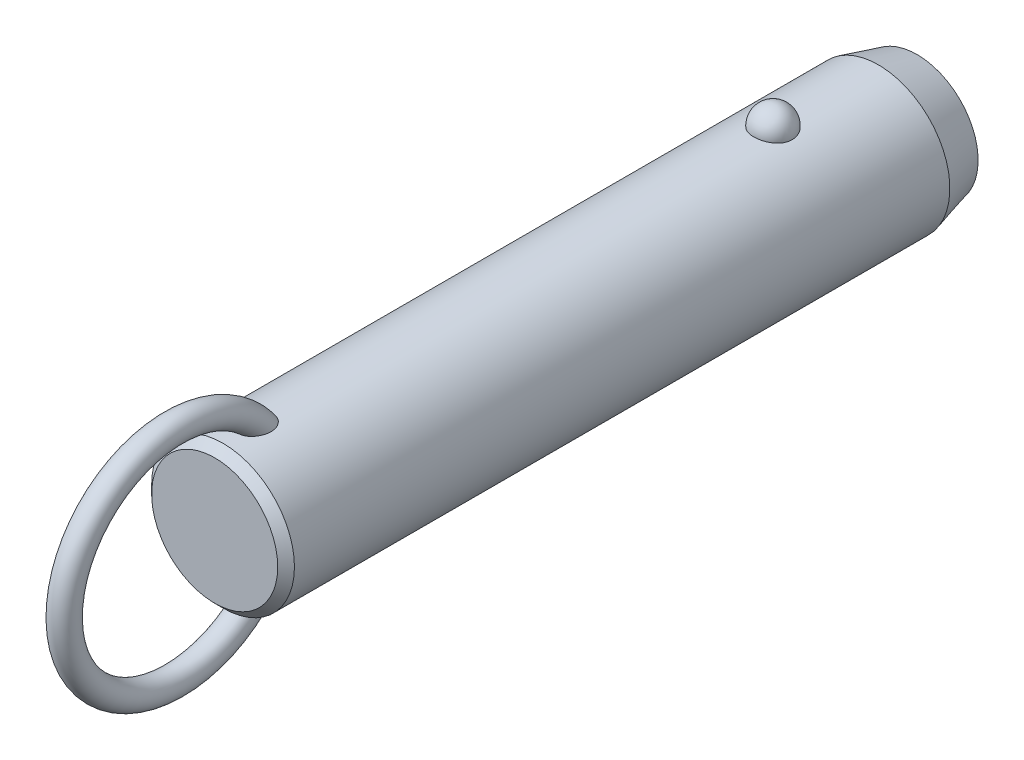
ISO-10303-21;
HEADER;
FILE_DESCRIPTION(('STEP AP214'),'2;1');
FILE_NAME('part.step','',(''),(''),'','','');
FILE_SCHEMA(('AUTOMOTIVE_DESIGN { 1 0 10303 214 1 1 1 1 }'));
ENDSEC;
DATA;
#1=APPLICATION_CONTEXT('core data for automotive mechanical design processes');
#2=APPLICATION_PROTOCOL_DEFINITION('international standard','automotive_design',2000,#1);
#3=PRODUCT_CONTEXT('',#1,'mechanical');
#4=PRODUCT('Part','Part','',(#3));
#5=PRODUCT_RELATED_PRODUCT_CATEGORY('part','',(#4));
#6=PRODUCT_DEFINITION_FORMATION('','',#4);
#7=PRODUCT_DEFINITION_CONTEXT('part definition',#1,'design');
#8=PRODUCT_DEFINITION('design','',#6,#7);
#9=PRODUCT_DEFINITION_SHAPE('','',#8);
#10=(LENGTH_UNIT() NAMED_UNIT(*) SI_UNIT(.MILLI.,.METRE.));
#11=(NAMED_UNIT(*) PLANE_ANGLE_UNIT() SI_UNIT($,.RADIAN.));
#12=(NAMED_UNIT(*) SI_UNIT($,.STERADIAN.) SOLID_ANGLE_UNIT());
#13=UNCERTAINTY_MEASURE_WITH_UNIT(LENGTH_MEASURE(1.E-05),#10,'distance_accuracy_value','');
#14=(GEOMETRIC_REPRESENTATION_CONTEXT(3) GLOBAL_UNCERTAINTY_ASSIGNED_CONTEXT((#13)) GLOBAL_UNIT_ASSIGNED_CONTEXT((#10,
#11,#12)) REPRESENTATION_CONTEXT('',''));
#15=CARTESIAN_POINT('',(0.,0.,0.));
#16=DIRECTION('',(0.,0.,1.));
#17=DIRECTION('',(1.,0.,0.));
#18=AXIS2_PLACEMENT_3D('',#15,#16,#17);
#19=CARTESIAN_POINT('',(0.,0.,71.1));
#20=DIRECTION('',(0.,0.,-1.));
#21=DIRECTION('',(-1.,0.,0.));
#22=AXIS2_PLACEMENT_3D('',#19,#20,#21);
#23=CYLINDRICAL_SURFACE('',#22,11.1);
#24=CARTESIAN_POINT('',(2.9724815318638,10.6945945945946,-3.));
#25=CARTESIAN_POINT('',(2.97247830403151,10.6945972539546,-2.83225059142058));
#26=CARTESIAN_POINT('',(2.95876598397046,10.6984356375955,-2.66445972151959));
#27=CARTESIAN_POINT('',(2.90424529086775,10.7133624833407,-2.33362381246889));
#28=CARTESIAN_POINT('',(2.8634252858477,10.7244540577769,-2.1705808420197));
#29=CARTESIAN_POINT('',(2.75573657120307,10.7526272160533,-1.85396767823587));
#30=CARTESIAN_POINT('',(2.68887937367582,10.7697061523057,-1.70039333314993));
#31=CARTESIAN_POINT('',(2.53079696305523,10.8079438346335,-1.40691598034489));
#32=CARTESIAN_POINT('',(2.43957264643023,10.8291024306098,-1.2670124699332));
#33=CARTESIAN_POINT('',(2.23458150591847,10.8732541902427,-1.00409565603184));
#34=CARTESIAN_POINT('',(2.12071295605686,10.8962553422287,-0.881162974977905));
#35=CARTESIAN_POINT('',(1.87365402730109,10.9414421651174,-0.656352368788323));
#36=CARTESIAN_POINT('',(1.74046358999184,10.9636278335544,-0.554474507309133));
#37=CARTESIAN_POINT('',(1.45872188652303,11.0046495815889,-0.374872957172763));
#38=CARTESIAN_POINT('',(1.31021276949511,11.0234944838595,-0.297085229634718));
#39=CARTESIAN_POINT('',(1.00170030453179,11.0557957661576,-0.167529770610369));
#40=CARTESIAN_POINT('',(0.841698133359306,11.0692526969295,-0.115759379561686));
#41=CARTESIAN_POINT('',(0.517607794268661,11.0890932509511,-0.0403925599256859));
#42=CARTESIAN_POINT('',(0.353633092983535,11.0955916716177,-0.0163383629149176));
#43=CARTESIAN_POINT('',(0.0238420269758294,11.1011989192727,0.0044517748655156));
#44=CARTESIAN_POINT('',(-0.141974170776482,11.1003084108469,0.00119017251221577));
#45=CARTESIAN_POINT('',(-0.468405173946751,11.0912990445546,-0.0323233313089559));
#46=CARTESIAN_POINT('',(-0.629059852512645,11.0832767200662,-0.0622147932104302));
#47=CARTESIAN_POINT('',(-0.942937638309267,11.0609962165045,-0.147645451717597));
#48=CARTESIAN_POINT('',(-1.09616062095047,11.0467379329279,-0.203185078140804));
#49=CARTESIAN_POINT('',(-1.39181061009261,11.0134071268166,-0.3387529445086));
#50=CARTESIAN_POINT('',(-1.53417383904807,10.9943086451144,-0.418913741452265));
#51=CARTESIAN_POINT('',(-1.80342160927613,10.9533667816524,-0.60144882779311));
#52=CARTESIAN_POINT('',(-1.9303046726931,10.9315231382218,-0.703825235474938));
#53=CARTESIAN_POINT('',(-2.16747598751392,10.887005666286,-0.930091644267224));
#54=CARTESIAN_POINT('',(-2.27742774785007,10.8643239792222,-1.05433291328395));
#55=CARTESIAN_POINT('',(-2.47517316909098,10.8209886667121,-1.31966633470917));
#56=CARTESIAN_POINT('',(-2.56296538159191,10.8003351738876,-1.46075958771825));
#57=CARTESIAN_POINT('',(-2.71500300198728,10.7631304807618,-1.75753646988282));
#58=CARTESIAN_POINT('',(-2.77898901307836,10.7466250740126,-1.91335887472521));
#59=CARTESIAN_POINT('',(-2.88046189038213,10.7198747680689,-2.2339152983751));
#60=CARTESIAN_POINT('',(-2.91794947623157,10.709629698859,-2.39864907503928));
#61=CARTESIAN_POINT('',(-2.96537819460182,10.6965949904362,-2.73165170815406));
#62=CARTESIAN_POINT('',(-2.97542891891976,10.693775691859,-2.89990378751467));
#63=CARTESIAN_POINT('',(-2.96804271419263,10.6958279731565,-3.235752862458));
#64=CARTESIAN_POINT('',(-2.95060646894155,10.7006993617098,-3.40334987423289));
#65=CARTESIAN_POINT('',(-2.88883358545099,10.71753912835,-3.73233906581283));
#66=CARTESIAN_POINT('',(-2.84462026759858,10.7294749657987,-3.89375610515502));
#67=CARTESIAN_POINT('',(-2.73050447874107,10.7590797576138,-4.20667949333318));
#68=CARTESIAN_POINT('',(-2.66060103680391,10.7767489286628,-4.35818546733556));
#69=CARTESIAN_POINT('',(-2.49642559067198,10.8159599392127,-4.6478542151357));
#70=CARTESIAN_POINT('',(-2.40203047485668,10.8375211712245,-4.78594458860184));
#71=CARTESIAN_POINT('',(-2.19143488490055,10.8820570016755,-5.0441038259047));
#72=CARTESIAN_POINT('',(-2.07523364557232,10.9050316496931,-5.16417205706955));
#73=CARTESIAN_POINT('',(-1.82361254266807,10.9499219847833,-5.38334833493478));
#74=CARTESIAN_POINT('',(-1.68812945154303,10.9718338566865,-5.48238464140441));
#75=CARTESIAN_POINT('',(-1.40191298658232,11.0120611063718,-5.65618873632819));
#76=CARTESIAN_POINT('',(-1.25118062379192,11.0303767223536,-5.73095813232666));
#77=CARTESIAN_POINT('',(-0.940570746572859,11.0611653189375,-5.85334725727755));
#78=CARTESIAN_POINT('',(-0.780821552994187,11.0737044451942,-5.90127578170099));
#79=CARTESIAN_POINT('',(-0.455204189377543,11.0918598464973,-5.96992976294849));
#80=CARTESIAN_POINT('',(-0.289336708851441,11.0974768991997,-5.99065827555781));
#81=CARTESIAN_POINT('',(0.0406846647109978,11.1011307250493,-6.00418773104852));
#82=CARTESIAN_POINT('',(0.204817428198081,11.099299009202,-5.99747318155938));
#83=CARTESIAN_POINT('',(0.5295530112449,11.088551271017,-5.9574031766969));
#84=CARTESIAN_POINT('',(0.69015594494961,11.0796354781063,-5.92404858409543));
#85=CARTESIAN_POINT('',(1.0027760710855,11.0557204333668,-5.83180084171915));
#86=CARTESIAN_POINT('',(1.15482001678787,11.0407414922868,-5.77299291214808));
#87=CARTESIAN_POINT('',(1.44678373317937,11.0062913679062,-5.63147366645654));
#88=CARTESIAN_POINT('',(1.58670279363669,10.9868199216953,-5.54876095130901));
#89=CARTESIAN_POINT('',(1.8527023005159,10.9451315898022,-5.36027644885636));
#90=CARTESIAN_POINT('',(1.97855158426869,10.9228788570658,-5.25418644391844));
#91=CARTESIAN_POINT('',(2.21080872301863,10.8782509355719,-5.02251354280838));
#92=CARTESIAN_POINT('',(2.31721312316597,10.8558757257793,-4.89692718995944));
#93=CARTESIAN_POINT('',(2.5094551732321,10.8130715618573,-4.62745408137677));
#94=CARTESIAN_POINT('',(2.59493284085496,10.7926798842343,-4.48330448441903));
#95=CARTESIAN_POINT('',(2.740862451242,10.7565495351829,-4.18236358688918));
#96=CARTESIAN_POINT('',(2.80132490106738,10.7408089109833,-4.02557762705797));
#97=CARTESIAN_POINT('',(2.88959070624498,10.7173718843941,-3.72475308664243));
#98=CARTESIAN_POINT('',(2.92062102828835,10.7088950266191,-3.58171216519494));
#99=CARTESIAN_POINT('',(2.96206765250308,10.6975052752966,-3.29245795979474));
#100=CARTESIAN_POINT('',(2.97248434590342,10.6945922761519,-3.14624473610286));
#101=CARTESIAN_POINT('',(2.9724815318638,10.6945945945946,-3.));
#102=B_SPLINE_CURVE_WITH_KNOTS('',3,(#24,#25,#26,#27,#28,#29,#30,#31,#32,#33,#34,#35,#36,#37,
#38,#39,#40,#41,#42,#43,#44,#45,#46,#47,#48,#49,#50,#51,#52,#53,#54,#55,#56,#57,#58,#59,#60,#61,
#62,#63,#64,#65,#66,#67,#68,#69,#70,#71,#72,#73,#74,#75,#76,#77,#78,#79,#80,#81,#82,#83,#84,#85,
#86,#87,#88,#89,#90,#91,#92,#93,#94,#95,#96,#97,#98,#99,#100,#101),.UNSPECIFIED.,.T.,.F.,(4,2,2,
2,2,2,2,2,2,2,2,2,2,2,2,2,2,2,2,2,2,2,2,2,2,2,2,2,2,2,2,2,2,2,2,2,2,2,4),(0.,0.502722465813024,
1.00566079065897,1.5083769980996,2.01107471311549,2.51608392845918,3.02109467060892,
3.52475118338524,4.02835620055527,4.523518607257,5.0186364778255,5.50715297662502,
5.9956776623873,6.48688002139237,6.97812923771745,7.47814366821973,7.9781907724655,
8.48353712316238,8.9888697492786,9.49218093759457,9.99547960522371,10.4964777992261,
10.997494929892,11.5010810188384,12.0046847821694,12.5099796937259,13.0152411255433,
13.5145635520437,14.0138298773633,14.5043200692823,14.9947943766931,15.4836390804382,
15.9725123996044,16.4685040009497,16.9645836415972,17.4686765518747,17.972557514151,
18.410841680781,18.849117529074),.UNSPECIFIED.);
#103=CARTESIAN_POINT('',(2.9724815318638,10.6945945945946,-3.));
#104=VERTEX_POINT('',#103);
#105=EDGE_CURVE('E41',#104,#104,#102,.T.);
#106=ORIENTED_EDGE('',*,*,#105,.T.);
#107=EDGE_LOOP('',(#106));
#108=FACE_BOUND('',#107,.T.);
#109=CARTESIAN_POINT('',(0.,0.,82.5));
#110=DIRECTION('',(0.,0.,1.));
#111=DIRECTION('',(1.,0.,0.));
#112=AXIS2_PLACEMENT_3D('',#109,#110,#111);
#113=CIRCLE('',#112,11.1);
#114=CARTESIAN_POINT('',(11.1,0.,82.5));
#115=VERTEX_POINT('',#114);
#116=EDGE_CURVE('E10',#115,#115,#113,.F.);
#117=ORIENTED_EDGE('',*,*,#116,.T.);
#118=EDGE_LOOP('',(#117));
#119=FACE_BOUND('',#118,.T.);
#120=CARTESIAN_POINT('',(-0.564520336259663,-11.0856356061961,74.757815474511));
#121=CARTESIAN_POINT('',(-0.667202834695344,-11.0804062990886,74.7912839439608));
#122=CARTESIAN_POINT('',(-0.766875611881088,-11.0738877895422,74.8338357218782));
#123=CARTESIAN_POINT('',(-0.957284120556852,-11.0590576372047,74.9354190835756));
#124=CARTESIAN_POINT('',(-1.04801616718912,-11.0507452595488,74.9944574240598));
#125=CARTESIAN_POINT('',(-1.21800952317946,-11.0333016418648,75.1265293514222));
#126=CARTESIAN_POINT('',(-1.29730805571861,-11.0241732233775,75.1995156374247));
#127=CARTESIAN_POINT('',(-1.44337665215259,-11.0060026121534,75.3570374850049));
#128=CARTESIAN_POINT('',(-1.51014622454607,-10.9969604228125,75.4415734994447));
#129=CARTESIAN_POINT('',(-1.63454620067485,-10.9791841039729,75.6255213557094));
#130=CARTESIAN_POINT('',(-1.69127003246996,-10.9705107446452,75.7255493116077));
#131=CARTESIAN_POINT('',(-1.78980785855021,-10.9548648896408,75.9327902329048));
#132=CARTESIAN_POINT('',(-1.83161214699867,-10.9478935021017,76.0400078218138));
#133=CARTESIAN_POINT('',(-1.91557028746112,-10.9335803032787,76.3054080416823));
#134=CARTESIAN_POINT('',(-1.95040620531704,-10.9273269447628,76.4659806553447));
#135=CARTESIAN_POINT('',(-1.99388326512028,-10.9194709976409,76.7906977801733));
#136=CARTESIAN_POINT('',(-2.00248051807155,-10.9178762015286,76.9548478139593));
#137=CARTESIAN_POINT('',(-1.99551615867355,-10.9191578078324,77.3246504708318));
#138=CARTESIAN_POINT('',(-1.9732206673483,-10.9232807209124,77.5301911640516));
#139=CARTESIAN_POINT('',(-1.91529761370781,-10.9335244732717,77.8335954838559));
#140=CARTESIAN_POINT('',(-1.8918457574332,-10.9376266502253,77.9340883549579));
#141=CARTESIAN_POINT('',(-1.83700674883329,-10.9469720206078,78.132855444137));
#142=CARTESIAN_POINT('',(-1.80562070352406,-10.9522150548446,78.2311299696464));
#143=CARTESIAN_POINT('',(-1.73463055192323,-10.9636837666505,78.4259148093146));
#144=CARTESIAN_POINT('',(-1.69493416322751,-10.9699202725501,78.5223907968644));
#145=CARTESIAN_POINT('',(-1.60745141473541,-10.9830806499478,78.7116262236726));
#146=CARTESIAN_POINT('',(-1.55966150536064,-10.9900048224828,78.8043840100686));
#147=CARTESIAN_POINT('',(-1.45591812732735,-11.0042280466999,78.9846907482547));
#148=CARTESIAN_POINT('',(-1.40000013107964,-11.0115253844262,79.0722601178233));
#149=CARTESIAN_POINT('',(-1.27937470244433,-11.0261911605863,79.2410298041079));
#150=CARTESIAN_POINT('',(-1.21467835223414,-11.0335594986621,79.3222379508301));
#151=CARTESIAN_POINT('',(-1.08218150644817,-11.0473027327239,79.4690010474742));
#152=CARTESIAN_POINT('',(-1.01522633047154,-11.0537063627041,79.535309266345));
#153=CARTESIAN_POINT('',(-0.872952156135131,-11.065850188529,79.6583780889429));
#154=CARTESIAN_POINT('',(-0.797642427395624,-11.0715911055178,79.7151491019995));
#155=CARTESIAN_POINT('',(-0.651396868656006,-11.081071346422,79.8075155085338));
#156=CARTESIAN_POINT('',(-0.581712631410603,-11.0849841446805,79.8450491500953));
#157=CARTESIAN_POINT('',(-0.437066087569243,-11.0916271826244,79.9082594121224));
#158=CARTESIAN_POINT('',(-0.362109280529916,-11.0943586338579,79.9339481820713));
#159=CARTESIAN_POINT('',(-0.207828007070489,-11.0983242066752,79.971117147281));
#160=CARTESIAN_POINT('',(-0.128467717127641,-11.0995432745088,79.9824545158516));
#161=CARTESIAN_POINT('',(0.0309101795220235,-11.1002423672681,79.9889658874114));
#162=CARTESIAN_POINT('',(0.110927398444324,-11.0997233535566,79.9841488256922));
#163=CARTESIAN_POINT('',(0.256406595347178,-11.097240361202,79.9609599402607));
#164=CARTESIAN_POINT('',(0.32223577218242,-11.0955074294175,79.9447543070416));
#165=CARTESIAN_POINT('',(0.450635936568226,-11.0910350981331,79.9026008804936));
#166=CARTESIAN_POINT('',(0.513205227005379,-11.0882951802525,79.8766480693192));
#167=CARTESIAN_POINT('',(0.662626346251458,-11.0805620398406,79.8026073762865));
#168=CARTESIAN_POINT('',(0.747127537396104,-11.0751144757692,79.7498452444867));
#169=CARTESIAN_POINT('',(0.906756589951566,-11.0631932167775,79.6317206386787));
#170=CARTESIAN_POINT('',(0.981859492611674,-11.0567168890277,79.5663257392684));
#171=CARTESIAN_POINT('',(1.10712207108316,-11.0447856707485,79.4422633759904));
#172=CARTESIAN_POINT('',(1.15909566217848,-11.0394280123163,79.3853831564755));
#173=CARTESIAN_POINT('',(1.25791923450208,-11.0286040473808,79.2673271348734));
#174=CARTESIAN_POINT('',(1.30476642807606,-11.0231376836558,79.2061490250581));
#175=CARTESIAN_POINT('',(1.43818612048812,-11.0068027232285,79.0173051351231));
#176=CARTESIAN_POINT('',(1.51751767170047,-10.9960104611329,78.8844531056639));
#177=CARTESIAN_POINT('',(1.63597546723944,-10.9788847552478,78.6531371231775));
#178=CARTESIAN_POINT('',(1.67988876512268,-10.9722190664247,78.5570530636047));
#179=CARTESIAN_POINT('',(1.75953241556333,-10.9597298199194,78.3614311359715));
#180=CARTESIAN_POINT('',(1.79525967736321,-10.9539065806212,78.2618919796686));
#181=CARTESIAN_POINT('',(1.85844731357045,-10.9433632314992,78.0602111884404));
#182=CARTESIAN_POINT('',(1.88591073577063,-10.9386427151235,77.9580705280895));
#183=CARTESIAN_POINT('',(1.93234324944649,-10.9305350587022,77.7518191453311));
#184=CARTESIAN_POINT('',(1.95131065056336,-10.9271481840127,77.6477080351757));
#185=CARTESIAN_POINT('',(1.99040203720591,-10.9201183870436,77.3654588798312));
#186=CARTESIAN_POINT('',(2.00221217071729,-10.9179256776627,77.1860370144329));
#187=CARTESIAN_POINT('',(1.99711676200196,-10.9188636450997,76.8277133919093));
#188=CARTESIAN_POINT('',(1.98026150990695,-10.9219849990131,76.648811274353));
#189=CARTESIAN_POINT('',(1.92151657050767,-10.9324473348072,76.3364514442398));
#190=CARTESIAN_POINT('',(1.88605081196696,-10.9386915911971,76.2017594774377));
#191=CARTESIAN_POINT('',(1.7939302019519,-10.9541780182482,75.9399669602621));
#192=CARTESIAN_POINT('',(1.73729868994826,-10.9634168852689,75.8128582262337));
#193=CARTESIAN_POINT('',(1.612370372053,-10.9824218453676,75.5894184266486));
#194=CARTESIAN_POINT('',(1.54715374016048,-10.9918945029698,75.4913455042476));
#195=CARTESIAN_POINT('',(1.40127026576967,-11.0114415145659,75.3074341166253));
#196=CARTESIAN_POINT('',(1.32060742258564,-11.0215157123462,75.2215924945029));
#197=CARTESIAN_POINT('',(1.14474787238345,-11.041168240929,75.0651630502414));
#198=CARTESIAN_POINT('',(1.04947805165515,-11.0507437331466,74.9946565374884));
#199=CARTESIAN_POINT('',(0.847278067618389,-11.0680789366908,74.872640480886));
#200=CARTESIAN_POINT('',(0.740351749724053,-11.0758392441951,74.8211246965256));
#201=CARTESIAN_POINT('',(0.529289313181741,-11.0878275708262,74.7434852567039));
#202=CARTESIAN_POINT('',(0.425895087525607,-11.0923259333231,74.715377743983));
#203=CARTESIAN_POINT('',(0.215723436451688,-11.0984001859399,74.6777038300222));
#204=CARTESIAN_POINT('',(0.108947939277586,-11.0999777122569,74.6681270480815));
#205=CARTESIAN_POINT('',(-0.0938962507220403,-11.1000196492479,74.6678773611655));
#206=CARTESIAN_POINT('',(-0.189967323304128,-11.0987797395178,74.6754089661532));
#207=CARTESIAN_POINT('',(-0.379657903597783,-11.0939111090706,74.7055079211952));
#208=CARTESIAN_POINT('',(-0.473277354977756,-11.0902823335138,74.7280756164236));
#209=CARTESIAN_POINT('',(-0.564520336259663,-11.0856356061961,74.757815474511));
#210=B_SPLINE_CURVE_WITH_KNOTS('',3,(#120,#121,#122,#123,#124,#125,#126,#127,#128,#129,#130,
#131,#132,#133,#134,#135,#136,#137,#138,#139,#140,#141,#142,#143,#144,#145,#146,#147,#148,#149,
#150,#151,#152,#153,#154,#155,#156,#157,#158,#159,#160,#161,#162,#163,#164,#165,#166,#167,#168,
#169,#170,#171,#172,#173,#174,#175,#176,#177,#178,#179,#180,#181,#182,#183,#184,#185,#186,#187,
#188,#189,#190,#191,#192,#193,#194,#195,#196,#197,#198,#199,#200,#201,#202,#203,#204,#205,#206,
#207,#208,#209),.UNSPECIFIED.,.T.,.F.,(4,2,2,2,2,2,2,2,2,2,2,2,2,2,2,2,2,2,2,2,2,2,2,2,2,2,2,2,
2,2,2,2,2,2,2,2,2,2,2,2,2,2,2,2,4),(0.,0.323999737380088,0.648132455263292,0.971184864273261,
1.29424994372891,1.6388623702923,1.98369857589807,2.47426059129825,2.96564271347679,
3.58257396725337,3.89215258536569,4.20168803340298,4.51486273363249,4.82817514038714,
5.14015911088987,5.45175282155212,5.73442856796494,6.01679375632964,6.25364580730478,
6.49025437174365,6.7291996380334,6.96801276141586,7.17061258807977,7.37331685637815,
7.67094989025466,7.96935728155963,8.2007506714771,8.43226927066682,8.89581623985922,
9.21306533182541,9.53043400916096,9.84768549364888,10.1650000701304,10.70229304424,
11.2386443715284,11.6553390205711,12.0715755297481,12.4245637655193,12.7774607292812,
13.1321855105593,13.4867936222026,13.8068771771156,14.1267813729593,14.4146787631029,
14.7025827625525),.UNSPECIFIED.);
#211=CARTESIAN_POINT('',(-0.564520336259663,-11.0856356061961,74.757815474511));
#212=VERTEX_POINT('',#211);
#213=EDGE_CURVE('E59',#212,#212,#210,.T.);
#214=ORIENTED_EDGE('',*,*,#213,.T.);
#215=EDGE_LOOP('',(#214));
#216=FACE_BOUND('',#215,.T.);
#217=CARTESIAN_POINT('',(-0.564520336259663,11.0856356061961,74.757815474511));
#218=CARTESIAN_POINT('',(-0.468542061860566,11.0905203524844,74.7265456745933));
#219=CARTESIAN_POINT('',(-0.36979381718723,11.0942886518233,74.7031576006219));
#220=CARTESIAN_POINT('',(-0.169555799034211,11.0991586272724,74.6730858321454));
#221=CARTESIAN_POINT('',(-0.0680604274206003,11.1002543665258,74.6664393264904));
#222=CARTESIAN_POINT('',(0.134549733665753,11.099646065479,74.6701579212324));
#223=CARTESIAN_POINT('',(0.235664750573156,11.0979441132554,74.6805103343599));
#224=CARTESIAN_POINT('',(0.43463240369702,11.0919342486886,74.7178318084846));
#225=CARTESIAN_POINT('',(0.532486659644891,11.0876276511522,74.7447924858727));
#226=CARTESIAN_POINT('',(0.722445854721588,11.0768742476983,74.8144096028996));
#227=CARTESIAN_POINT('',(0.814543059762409,11.0704246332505,74.8570866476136));
#228=CARTESIAN_POINT('',(0.99056508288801,11.0560659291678,74.9566487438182));
#229=CARTESIAN_POINT('',(1.07448844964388,11.048156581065,75.0135363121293));
#230=CARTESIAN_POINT('',(1.23562672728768,11.0313221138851,75.1422106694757));
#231=CARTESIAN_POINT('',(1.31242684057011,11.0223686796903,75.2145117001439));
#232=CARTESIAN_POINT('',(1.45398030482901,11.0045918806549,75.3700425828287));
#233=CARTESIAN_POINT('',(1.51873073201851,10.9957685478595,75.4532750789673));
#234=CARTESIAN_POINT('',(1.64107232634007,10.9782087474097,75.6363842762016));
#235=CARTESIAN_POINT('',(1.69743176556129,10.9695572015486,75.7370893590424));
#236=CARTESIAN_POINT('',(1.79515063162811,10.9539887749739,75.9456264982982));
#237=CARTESIAN_POINT('',(1.83649966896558,10.9470730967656,76.0534634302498));
#238=CARTESIAN_POINT('',(1.91931148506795,10.9329211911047,76.3203995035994));
#239=CARTESIAN_POINT('',(1.9534010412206,10.9267904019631,76.4818612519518));
#240=CARTESIAN_POINT('',(1.99526195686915,10.9192174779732,76.8082163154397));
#241=CARTESIAN_POINT('',(2.00298989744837,10.9177830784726,76.9731148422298));
#242=CARTESIAN_POINT('',(1.99396251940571,10.9194420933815,77.3441006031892));
#243=CARTESIAN_POINT('',(1.97050829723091,10.923774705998,77.5500387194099));
#244=CARTESIAN_POINT('',(1.91079643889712,10.9343131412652,77.8539019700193));
#245=CARTESIAN_POINT('',(1.88673702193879,10.9385106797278,77.9545296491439));
#246=CARTESIAN_POINT('',(1.83065508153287,10.9480376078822,78.1535107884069));
#247=CARTESIAN_POINT('',(1.79863369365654,10.9533668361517,78.251864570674));
#248=CARTESIAN_POINT('',(1.72633365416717,10.9649954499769,78.446720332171));
#249=CARTESIAN_POINT('',(1.68596409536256,10.9713053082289,78.5431879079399));
#250=CARTESIAN_POINT('',(1.59707998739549,10.9845964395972,78.7323233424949));
#251=CARTESIAN_POINT('',(1.54856169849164,10.9915780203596,78.8249894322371));
#252=CARTESIAN_POINT('',(1.44330168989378,11.0058935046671,79.0049752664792));
#253=CARTESIAN_POINT('',(1.38659749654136,11.0132257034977,79.092316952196));
#254=CARTESIAN_POINT('',(1.26431158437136,11.0279330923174,79.2604563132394));
#255=CARTESIAN_POINT('',(1.19874160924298,11.0353082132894,79.3412624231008));
#256=CARTESIAN_POINT('',(1.06542088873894,11.0489310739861,79.4859856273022));
#257=CARTESIAN_POINT('',(0.998640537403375,11.0552153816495,79.550784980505));
#258=CARTESIAN_POINT('',(0.856896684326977,11.0671032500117,79.6708462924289));
#259=CARTESIAN_POINT('',(0.781942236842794,11.0727075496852,79.7261186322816));
#260=CARTESIAN_POINT('',(0.636276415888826,11.081949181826,79.8159721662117));
#261=CARTESIAN_POINT('',(0.566755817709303,11.0857572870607,79.8524410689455));
#262=CARTESIAN_POINT('',(0.422602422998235,11.0921860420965,79.9135333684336));
#263=CARTESIAN_POINT('',(0.347974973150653,11.0948079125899,79.9381689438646));
#264=CARTESIAN_POINT('',(0.194593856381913,11.0985608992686,79.9733233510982));
#265=CARTESIAN_POINT('',(0.115807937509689,11.0996777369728,79.9837069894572));
#266=CARTESIAN_POINT('',(-0.0422499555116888,11.1002003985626,79.9885747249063));
#267=CARTESIAN_POINT('',(-0.121521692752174,11.09960699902,79.983066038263));
#268=CARTESIAN_POINT('',(-0.266046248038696,11.0970123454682,79.9588271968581));
#269=CARTESIAN_POINT('',(-0.331661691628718,11.0952283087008,79.9421356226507));
#270=CARTESIAN_POINT('',(-0.459588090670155,11.0906663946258,79.8991117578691));
#271=CARTESIAN_POINT('',(-0.521897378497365,11.0878880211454,79.872774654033));
#272=CARTESIAN_POINT('',(-0.671446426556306,11.0800342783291,79.7975130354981));
#273=CARTESIAN_POINT('',(-0.756250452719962,11.0744969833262,79.7438182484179));
#274=CARTESIAN_POINT('',(-0.916349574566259,11.0624045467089,79.6238029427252));
#275=CARTESIAN_POINT('',(-0.99161892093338,11.0558467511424,79.5574493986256));
#276=CARTESIAN_POINT('',(-1.11713140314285,11.0437783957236,79.4316335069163));
#277=CARTESIAN_POINT('',(-1.16920539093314,11.0383619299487,79.3739524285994));
#278=CARTESIAN_POINT('',(-1.26817476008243,11.02743010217,79.2542809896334));
#279=CARTESIAN_POINT('',(-1.31506731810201,11.0219146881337,79.1922883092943));
#280=CARTESIAN_POINT('',(-1.40399813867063,11.0109399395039,79.0647843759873));
#281=CARTESIAN_POINT('',(-1.4460286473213,11.0054807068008,78.9992677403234));
#282=CARTESIAN_POINT('',(-1.52538779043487,10.9947621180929,78.8654223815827));
#283=CARTESIAN_POINT('',(-1.56271516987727,10.9895028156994,78.7970929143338));
#284=CARTESIAN_POINT('',(-1.64537943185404,10.9774790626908,78.6332101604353));
#285=CARTESIAN_POINT('',(-1.68879497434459,10.9708503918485,78.5366735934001));
#286=CARTESIAN_POINT('',(-1.76740738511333,10.9584602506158,78.3402369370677));
#287=CARTESIAN_POINT('',(-1.80260120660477,10.95269910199,78.2403356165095));
#288=CARTESIAN_POINT('',(-1.86468657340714,10.9423003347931,78.0379663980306));
#289=CARTESIAN_POINT('',(-1.8915816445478,10.9376622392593,77.9354996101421));
#290=CARTESIAN_POINT('',(-1.93682458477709,10.9297405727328,77.7286429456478));
#291=CARTESIAN_POINT('',(-1.9551708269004,10.9264572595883,77.6242527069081));
#292=CARTESIAN_POINT('',(-1.99232562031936,10.9197647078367,77.3426287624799));
#293=CARTESIAN_POINT('',(-2.00294603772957,10.9177914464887,77.1641857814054));
#294=CARTESIAN_POINT('',(-1.99566675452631,10.9191290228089,76.8079962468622));
#295=CARTESIAN_POINT('',(-1.97781651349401,10.9224306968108,76.6302490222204));
#296=CARTESIAN_POINT('',(-1.91747214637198,10.9331592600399,76.3197921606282));
#297=CARTESIAN_POINT('',(-1.88131022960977,10.9395108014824,76.185825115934));
#298=CARTESIAN_POINT('',(-1.7879038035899,10.9551659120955,75.9255975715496));
#299=CARTESIAN_POINT('',(-1.7306830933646,10.9644661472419,75.7993285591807));
#300=CARTESIAN_POINT('',(-1.60475573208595,10.9835398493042,75.5774156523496));
#301=CARTESIAN_POINT('',(-1.53908879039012,10.9930297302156,75.4800265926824));
#302=CARTESIAN_POINT('',(-1.39238608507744,11.0125708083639,75.2975250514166));
#303=CARTESIAN_POINT('',(-1.31135150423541,11.0226219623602,75.2124116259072));
#304=CARTESIAN_POINT('',(-1.14382035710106,11.0411991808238,75.0652994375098));
#305=CARTESIAN_POINT('',(-1.05858500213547,11.0497792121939,75.0018693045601));
#306=CARTESIAN_POINT('',(-0.878723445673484,11.0655285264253,74.8902505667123));
#307=CARTESIAN_POINT('',(-0.784123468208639,11.0727015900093,74.8420208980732));
#308=CARTESIAN_POINT('',(-0.646163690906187,11.0812501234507,74.786023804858));
#309=CARTESIAN_POINT('',(-0.605595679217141,11.0835451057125,74.7711978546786));
#310=CARTESIAN_POINT('',(-0.564520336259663,11.0856356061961,74.757815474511));
#311=B_SPLINE_CURVE_WITH_KNOTS('',3,(#217,#218,#219,#220,#221,#222,#223,#224,#225,#226,#227,
#228,#229,#230,#231,#232,#233,#234,#235,#236,#237,#238,#239,#240,#241,#242,#243,#244,#245,#246,
#247,#248,#249,#250,#251,#252,#253,#254,#255,#256,#257,#258,#259,#260,#261,#262,#263,#264,#265,
#266,#267,#268,#269,#270,#271,#272,#273,#274,#275,#276,#277,#278,#279,#280,#281,#282,#283,#284,
#285,#286,#287,#288,#289,#290,#291,#292,#293,#294,#295,#296,#297,#298,#299,#300,#301,#302,#303,
#304,#305,#306,#307,#308,#309,#310),.UNSPECIFIED.,.T.,.F.,(4,2,2,2,2,2,2,2,2,2,2,2,2,2,2,2,2,2,
2,2,2,2,2,2,2,2,2,2,2,2,2,2,2,2,2,2,2,2,2,2,2,2,2,2,2,2,4),(0.,0.303061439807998,
0.606795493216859,0.910302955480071,1.21365733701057,1.51741085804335,1.82121821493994,
2.13745205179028,2.45376252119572,2.79958678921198,3.14564996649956,3.63832391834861,
4.13180893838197,4.75031912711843,5.06071926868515,5.37107516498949,5.68500772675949,
5.99908475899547,6.31176519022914,6.62403542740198,6.90315673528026,7.1819719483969,
7.41687778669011,7.65154134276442,7.88841587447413,8.12518286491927,8.3275284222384,
8.52997509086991,8.82986421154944,9.13054668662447,9.36393502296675,9.59744991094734,
9.83133221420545,10.0652767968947,10.383032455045,10.7009056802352,11.0186436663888,
11.3364420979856,11.8705925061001,12.4038159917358,12.8189662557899,13.2336487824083,
13.5857049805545,13.9377340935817,14.2561354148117,14.5736690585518,14.7033687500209),.UNSPECIFIED.);
#312=CARTESIAN_POINT('',(-0.564520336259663,11.0856356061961,74.757815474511));
#313=VERTEX_POINT('',#312);
#314=EDGE_CURVE('E67',#313,#313,#311,.T.);
#315=ORIENTED_EDGE('',*,*,#314,.T.);
#316=EDGE_LOOP('',(#315));
#317=FACE_BOUND('',#316,.T.);
#318=CARTESIAN_POINT('',(0.,0.,-19.3999999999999));
#319=DIRECTION('',(0.,0.,-1.));
#320=DIRECTION('',(-1.,0.,0.));
#321=AXIS2_PLACEMENT_3D('',#318,#319,#320);
#322=CIRCLE('',#321,11.1);
#323=CARTESIAN_POINT('',(-11.1,0.,-19.3999999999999));
#324=VERTEX_POINT('',#323);
#325=EDGE_CURVE('E56',#324,#324,#322,.F.);
#326=ORIENTED_EDGE('',*,*,#325,.T.);
#327=EDGE_LOOP('',(#326));
#328=FACE_BOUND('',#327,.T.);
#329=ADVANCED_FACE('F37',(#108,#119,#216,#317,#328),#23,.T.);
#330=CARTESIAN_POINT('',(0.,0.,-25.4));
#331=DIRECTION('',(0.,0.,-1.));
#332=DIRECTION('',(-1.,0.,0.));
#333=AXIS2_PLACEMENT_3D('',#330,#331,#332);
#334=PLANE('',#333);
#335=CARTESIAN_POINT('',(0.,0.,-25.4));
#336=DIRECTION('',(0.,0.,-1.));
#337=DIRECTION('',(-1.,0.,0.));
#338=AXIS2_PLACEMENT_3D('',#335,#336,#337);
#339=CIRCLE('',#338,9.49230484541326);
#340=CARTESIAN_POINT('',(-9.49230484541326,0.,-25.4));
#341=VERTEX_POINT('',#340);
#342=EDGE_CURVE('E66',#341,#341,#339,.T.);
#343=ORIENTED_EDGE('',*,*,#342,.T.);
#344=EDGE_LOOP('',(#343));
#345=FACE_BOUND('',#344,.T.);
#346=ADVANCED_FACE('F85',(#345),#334,.T.);
#347=CARTESIAN_POINT('',(0.,0.,-25.4));
#348=DIRECTION('',(0.,0.,1.));
#349=DIRECTION('',(1.,0.,0.));
#350=AXIS2_PLACEMENT_3D('',#347,#348,#349);
#351=CONICAL_SURFACE('',#350,9.49230484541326,0.261799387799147);
#352=ORIENTED_EDGE('',*,*,#325,.F.);
#353=EDGE_LOOP('',(#352));
#354=FACE_BOUND('',#353,.T.);
#355=ORIENTED_EDGE('',*,*,#342,.F.);
#356=EDGE_LOOP('',(#355));
#357=FACE_BOUND('',#356,.T.);
#358=ADVANCED_FACE('F83',(#354,#357),#351,.T.);
#359=CARTESIAN_POINT('',(0.,0.,83.8));
#360=DIRECTION('',(0.,0.,1.));
#361=DIRECTION('',(1.,0.,0.));
#362=AXIS2_PLACEMENT_3D('',#359,#360,#361);
#363=PLANE('',#362);
#364=CARTESIAN_POINT('',(0.,0.,83.8));
#365=DIRECTION('',(0.,0.,1.));
#366=DIRECTION('',(1.,0.,0.));
#367=AXIS2_PLACEMENT_3D('',#364,#365,#366);
#368=CIRCLE('',#367,9.79999999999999);
#369=CARTESIAN_POINT('',(9.79999999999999,0.,83.8));
#370=VERTEX_POINT('',#369);
#371=EDGE_CURVE('E50',#370,#370,#368,.T.);
#372=ORIENTED_EDGE('',*,*,#371,.T.);
#373=EDGE_LOOP('',(#372));
#374=FACE_BOUND('',#373,.T.);
#375=ADVANCED_FACE('F77',(#374),#363,.T.);
#376=CARTESIAN_POINT('',(0.,0.,90.15));
#377=DIRECTION('',(1.,0.,0.));
#378=DIRECTION('',(0.,0.,-1.));
#379=AXIS2_PLACEMENT_3D('',#376,#377,#378);
#380=TOROIDAL_SURFACE('',#379,17.05,2.);
#381=ORIENTED_EDGE('',*,*,#314,.F.);
#382=EDGE_LOOP('',(#381));
#383=FACE_BOUND('',#382,.T.);
#384=ORIENTED_EDGE('',*,*,#213,.F.);
#385=EDGE_LOOP('',(#384));
#386=FACE_BOUND('',#385,.T.);
#387=ADVANCED_FACE('F73',(#383,#386),#380,.T.);
#388=CARTESIAN_POINT('',(0.,0.,83.8));
#389=DIRECTION('',(0.,0.,-1.));
#390=DIRECTION('',(-1.,0.,0.));
#391=AXIS2_PLACEMENT_3D('',#388,#389,#390);
#392=CONICAL_SURFACE('',#391,9.79999999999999,0.785398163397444);
#393=ORIENTED_EDGE('',*,*,#116,.F.);
#394=EDGE_LOOP('',(#393));
#395=FACE_BOUND('',#394,.T.);
#396=ORIENTED_EDGE('',*,*,#371,.F.);
#397=EDGE_LOOP('',(#396));
#398=FACE_BOUND('',#397,.T.);
#399=ADVANCED_FACE('F39',(#395,#398),#392,.T.);
#400=CARTESIAN_POINT('',(0.,11.1,-3.));
#401=DIRECTION('',(0.,1.,0.));
#402=DIRECTION('',(0.,0.,-1.));
#403=AXIS2_PLACEMENT_3D('',#400,#401,#402);
#404=SPHERICAL_SURFACE('',#403,3.);
#405=ORIENTED_EDGE('',*,*,#105,.F.);
#406=EDGE_LOOP('',(#405));
#407=FACE_BOUND('',#406,.T.);
#408=ADVANCED_FACE('F79',(#407),#404,.T.);
#409=CLOSED_SHELL('',(#329,#346,#358,#375,#387,#399,#408));
#410=MANIFOLD_SOLID_BREP('B2',#409);
#411=ADVANCED_BREP_SHAPE_REPRESENTATION('',(#18,#410),#14);
#412=SHAPE_DEFINITION_REPRESENTATION(#9,#411);
ENDSEC;
END-ISO-10303-21;
